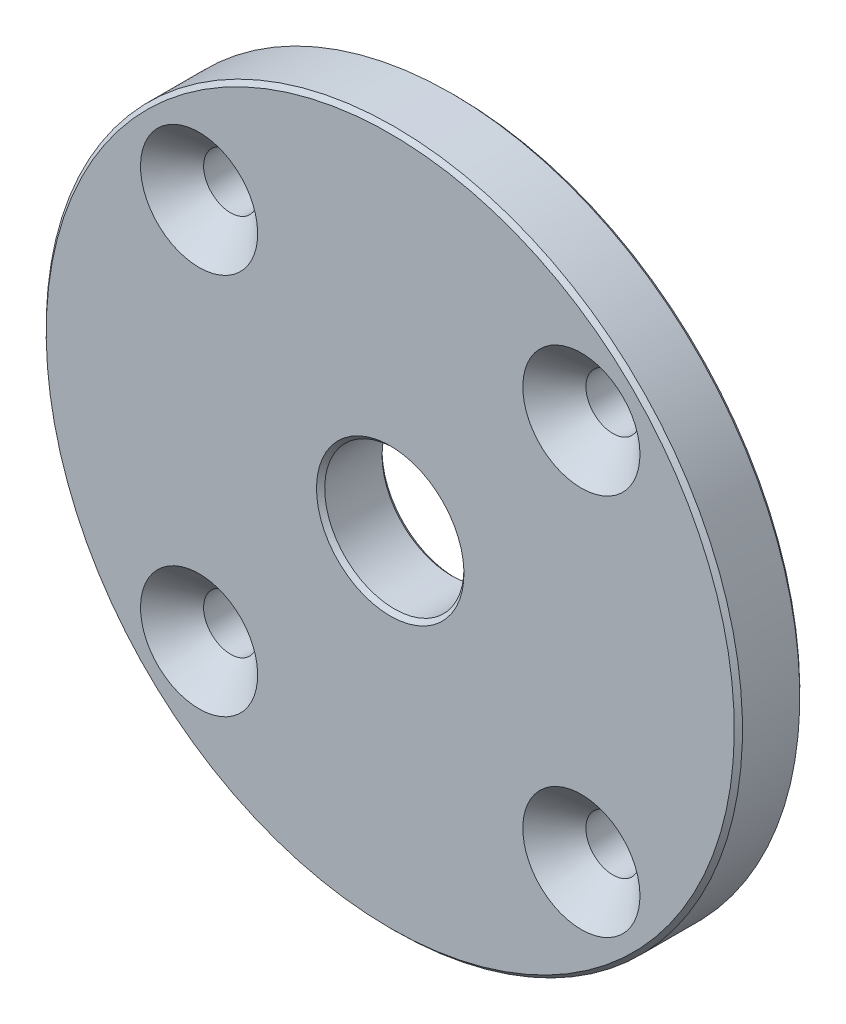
ISO-10303-21;
HEADER;
FILE_DESCRIPTION(('STEP AP214'),'2;1');
FILE_NAME('part.step','',(''),(''),'','','');
FILE_SCHEMA(('AUTOMOTIVE_DESIGN { 1 0 10303 214 1 1 1 1 }'));
ENDSEC;
DATA;
#1=APPLICATION_CONTEXT('core data for automotive mechanical design processes');
#2=APPLICATION_PROTOCOL_DEFINITION('international standard','automotive_design',2000,#1);
#3=PRODUCT_CONTEXT('',#1,'mechanical');
#4=PRODUCT('Part','Part','',(#3));
#5=PRODUCT_RELATED_PRODUCT_CATEGORY('part','',(#4));
#6=PRODUCT_DEFINITION_FORMATION('','',#4);
#7=PRODUCT_DEFINITION_CONTEXT('part definition',#1,'design');
#8=PRODUCT_DEFINITION('design','',#6,#7);
#9=PRODUCT_DEFINITION_SHAPE('','',#8);
#10=(LENGTH_UNIT() NAMED_UNIT(*) SI_UNIT(.MILLI.,.METRE.));
#11=(NAMED_UNIT(*) PLANE_ANGLE_UNIT() SI_UNIT($,.RADIAN.));
#12=(NAMED_UNIT(*) SI_UNIT($,.STERADIAN.) SOLID_ANGLE_UNIT());
#13=UNCERTAINTY_MEASURE_WITH_UNIT(LENGTH_MEASURE(1.E-05),#10,'distance_accuracy_value','');
#14=(GEOMETRIC_REPRESENTATION_CONTEXT(3) GLOBAL_UNCERTAINTY_ASSIGNED_CONTEXT((#13)) GLOBAL_UNIT_ASSIGNED_CONTEXT((#10,
#11,#12)) REPRESENTATION_CONTEXT('',''));
#15=CARTESIAN_POINT('',(0.,0.,0.));
#16=DIRECTION('',(0.,0.,1.));
#17=DIRECTION('',(1.,0.,0.));
#18=AXIS2_PLACEMENT_3D('',#15,#16,#17);
#19=CARTESIAN_POINT('',(0.,0.,0.));
#20=DIRECTION('',(0.,0.,1.));
#21=DIRECTION('',(0.,-1.,0.));
#22=AXIS2_PLACEMENT_3D('',#19,#20,#21);
#23=CYLINDRICAL_SURFACE('',#22,8.5);
#24=CARTESIAN_POINT('',(0.,0.,-7.5));
#25=DIRECTION('',(0.,0.,-1.));
#26=DIRECTION('',(0.,1.,0.));
#27=AXIS2_PLACEMENT_3D('',#24,#25,#26);
#28=CIRCLE('',#27,8.5);
#29=CARTESIAN_POINT('',(0.,8.49999999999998,-7.50000000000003));
#30=VERTEX_POINT('',#29);
#31=EDGE_CURVE('E37',#30,#30,#28,.T.);
#32=ORIENTED_EDGE('',*,*,#31,.T.);
#33=EDGE_LOOP('',(#32));
#34=FACE_BOUND('',#33,.T.);
#35=CARTESIAN_POINT('',(0.,0.,-0.499999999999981));
#36=DIRECTION('',(0.,0.,1.));
#37=DIRECTION('',(0.,-1.,0.));
#38=AXIS2_PLACEMENT_3D('',#35,#36,#37);
#39=CIRCLE('',#38,8.5);
#40=CARTESIAN_POINT('',(0.,-8.5,-0.499999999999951));
#41=VERTEX_POINT('',#40);
#42=EDGE_CURVE('E40',#41,#41,#39,.T.);
#43=ORIENTED_EDGE('',*,*,#42,.T.);
#44=EDGE_LOOP('',(#43));
#45=FACE_BOUND('',#44,.T.);
#46=ADVANCED_FACE('F14',(#34,#45),#23,.F.);
#47=CARTESIAN_POINT('',(8.5,0.,-8.));
#48=DIRECTION('',(0.,0.,-1.));
#49=DIRECTION('',(0.,1.,0.));
#50=AXIS2_PLACEMENT_3D('',#47,#48,#49);
#51=PLANE('',#50);
#52=CARTESIAN_POINT('',(-23.3345237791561,23.334523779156,-8.));
#53=DIRECTION('',(0.,0.,-1.));
#54=DIRECTION('',(0.,1.,0.));
#55=AXIS2_PLACEMENT_3D('',#52,#53,#54);
#56=CIRCLE('',#55,3.3);
#57=CARTESIAN_POINT('',(-23.3345237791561,26.634523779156,-8.00000000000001));
#58=VERTEX_POINT('',#57);
#59=EDGE_CURVE('E9',#58,#58,#56,.T.);
#60=ORIENTED_EDGE('',*,*,#59,.F.);
#61=EDGE_LOOP('',(#60));
#62=FACE_BOUND('',#61,.T.);
#63=CARTESIAN_POINT('',(-23.334523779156,-23.3345237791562,-8.));
#64=DIRECTION('',(0.,0.,-1.));
#65=DIRECTION('',(0.,1.,0.));
#66=AXIS2_PLACEMENT_3D('',#63,#64,#65);
#67=CIRCLE('',#66,3.3);
#68=CARTESIAN_POINT('',(-23.334523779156,-20.0345237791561,-8.00000000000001));
#69=VERTEX_POINT('',#68);
#70=EDGE_CURVE('E21',#69,#69,#67,.T.);
#71=ORIENTED_EDGE('',*,*,#70,.F.);
#72=EDGE_LOOP('',(#71));
#73=FACE_BOUND('',#72,.T.);
#74=CARTESIAN_POINT('',(23.3345237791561,-23.3345237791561,-8.));
#75=DIRECTION('',(0.,0.,-1.));
#76=DIRECTION('',(0.,1.,0.));
#77=AXIS2_PLACEMENT_3D('',#74,#75,#76);
#78=CIRCLE('',#77,3.3);
#79=CARTESIAN_POINT('',(23.3345237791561,-20.0345237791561,-8.00000000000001));
#80=VERTEX_POINT('',#79);
#81=EDGE_CURVE('E25',#80,#80,#78,.T.);
#82=ORIENTED_EDGE('',*,*,#81,.F.);
#83=EDGE_LOOP('',(#82));
#84=FACE_BOUND('',#83,.T.);
#85=CARTESIAN_POINT('',(23.334523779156,23.334523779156,-8.));
#86=DIRECTION('',(0.,0.,-1.));
#87=DIRECTION('',(0.,1.,0.));
#88=AXIS2_PLACEMENT_3D('',#85,#86,#87);
#89=CIRCLE('',#88,3.3);
#90=CARTESIAN_POINT('',(23.334523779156,26.634523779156,-8.00000000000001));
#91=VERTEX_POINT('',#90);
#92=EDGE_CURVE('E29',#91,#91,#89,.T.);
#93=ORIENTED_EDGE('',*,*,#92,.F.);
#94=EDGE_LOOP('',(#93));
#95=FACE_BOUND('',#94,.T.);
#96=CARTESIAN_POINT('',(0.,0.,-8.));
#97=DIRECTION('',(0.,0.,-1.));
#98=DIRECTION('',(0.,1.,0.));
#99=AXIS2_PLACEMENT_3D('',#96,#97,#98);
#100=CIRCLE('',#99,9.);
#101=CARTESIAN_POINT('',(0.,8.99999999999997,-8.00000000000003));
#102=VERTEX_POINT('',#101);
#103=EDGE_CURVE('E43',#102,#102,#100,.F.);
#104=ORIENTED_EDGE('',*,*,#103,.T.);
#105=EDGE_LOOP('',(#104));
#106=FACE_BOUND('',#105,.T.);
#107=CARTESIAN_POINT('',(0.,0.,-8.));
#108=DIRECTION('',(0.,0.,-1.));
#109=DIRECTION('',(0.,1.,0.));
#110=AXIS2_PLACEMENT_3D('',#107,#108,#109);
#111=CIRCLE('',#110,42.);
#112=CARTESIAN_POINT('',(0.,42.,-8.00000000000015));
#113=VERTEX_POINT('',#112);
#114=EDGE_CURVE('E46',#113,#113,#111,.T.);
#115=ORIENTED_EDGE('',*,*,#114,.T.);
#116=EDGE_LOOP('',(#115));
#117=FACE_BOUND('',#116,.T.);
#118=ADVANCED_FACE('F114',(#62,#73,#84,#95,#106,#117),#51,.T.);
#119=CARTESIAN_POINT('',(0.,0.,0.));
#120=DIRECTION('',(0.,0.,1.));
#121=DIRECTION('',(0.,-1.,0.));
#122=AXIS2_PLACEMENT_3D('',#119,#120,#121);
#123=CYLINDRICAL_SURFACE('',#122,42.5);
#124=CARTESIAN_POINT('',(0.,0.,-0.500000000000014));
#125=DIRECTION('',(0.,0.,1.));
#126=DIRECTION('',(0.,-1.,0.));
#127=AXIS2_PLACEMENT_3D('',#124,#125,#126);
#128=CIRCLE('',#127,42.5);
#129=CARTESIAN_POINT('',(0.,-42.5,-0.499999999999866));
#130=VERTEX_POINT('',#129);
#131=EDGE_CURVE('E49',#130,#130,#128,.F.);
#132=ORIENTED_EDGE('',*,*,#131,.T.);
#133=EDGE_LOOP('',(#132));
#134=FACE_BOUND('',#133,.T.);
#135=CARTESIAN_POINT('',(0.,0.,-7.5));
#136=DIRECTION('',(0.,0.,-1.));
#137=DIRECTION('',(0.,1.,0.));
#138=AXIS2_PLACEMENT_3D('',#135,#136,#137);
#139=CIRCLE('',#138,42.5);
#140=CARTESIAN_POINT('',(0.,42.5,-7.50000000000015));
#141=VERTEX_POINT('',#140);
#142=EDGE_CURVE('E52',#141,#141,#139,.F.);
#143=ORIENTED_EDGE('',*,*,#142,.T.);
#144=EDGE_LOOP('',(#143));
#145=FACE_BOUND('',#144,.T.);
#146=ADVANCED_FACE('F89',(#134,#145),#123,.T.);
#147=CARTESIAN_POINT('',(8.5,0.,0.));
#148=DIRECTION('',(0.,0.,1.));
#149=DIRECTION('',(0.,-1.,0.));
#150=AXIS2_PLACEMENT_3D('',#147,#148,#149);
#151=PLANE('',#150);
#152=CARTESIAN_POINT('',(0.,0.,0.));
#153=DIRECTION('',(0.,0.,1.));
#154=DIRECTION('',(0.,-1.,0.));
#155=AXIS2_PLACEMENT_3D('',#152,#153,#154);
#156=CIRCLE('',#155,9.);
#157=CARTESIAN_POINT('',(0.,-9.,0.));
#158=VERTEX_POINT('',#157);
#159=EDGE_CURVE('E34',#158,#158,#156,.F.);
#160=ORIENTED_EDGE('',*,*,#159,.T.);
#161=EDGE_LOOP('',(#160));
#162=FACE_BOUND('',#161,.T.);
#163=CARTESIAN_POINT('',(23.334523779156,23.3345237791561,0.));
#164=DIRECTION('',(0.,0.,1.));
#165=DIRECTION('',(0.,-1.,0.));
#166=AXIS2_PLACEMENT_3D('',#163,#164,#165);
#167=CIRCLE('',#166,7.15);
#168=CARTESIAN_POINT('',(23.334523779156,16.1845237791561,0.));
#169=VERTEX_POINT('',#168);
#170=EDGE_CURVE('E79',#169,#169,#167,.T.);
#171=ORIENTED_EDGE('',*,*,#170,.F.);
#172=EDGE_LOOP('',(#171));
#173=FACE_BOUND('',#172,.T.);
#174=CARTESIAN_POINT('',(23.3345237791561,-23.334523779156,0.));
#175=DIRECTION('',(0.,0.,1.));
#176=DIRECTION('',(0.,-1.,0.));
#177=AXIS2_PLACEMENT_3D('',#174,#175,#176);
#178=CIRCLE('',#177,7.15);
#179=CARTESIAN_POINT('',(23.3345237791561,-30.484523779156,1.06436145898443E-13));
#180=VERTEX_POINT('',#179);
#181=EDGE_CURVE('E73',#180,#180,#178,.T.);
#182=ORIENTED_EDGE('',*,*,#181,.F.);
#183=EDGE_LOOP('',(#182));
#184=FACE_BOUND('',#183,.T.);
#185=CARTESIAN_POINT('',(-23.334523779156,-23.3345237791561,0.));
#186=DIRECTION('',(0.,0.,1.));
#187=DIRECTION('',(0.,-1.,0.));
#188=AXIS2_PLACEMENT_3D('',#185,#186,#187);
#189=CIRCLE('',#188,7.15);
#190=CARTESIAN_POINT('',(-23.334523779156,-30.4845237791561,1.06436145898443E-13));
#191=VERTEX_POINT('',#190);
#192=EDGE_CURVE('E67',#191,#191,#189,.T.);
#193=ORIENTED_EDGE('',*,*,#192,.F.);
#194=EDGE_LOOP('',(#193));
#195=FACE_BOUND('',#194,.T.);
#196=CARTESIAN_POINT('',(-23.3345237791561,23.334523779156,0.));
#197=DIRECTION('',(0.,0.,1.));
#198=DIRECTION('',(0.,-1.,0.));
#199=AXIS2_PLACEMENT_3D('',#196,#197,#198);
#200=CIRCLE('',#199,7.15);
#201=CARTESIAN_POINT('',(-23.3345237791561,16.184523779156,0.));
#202=VERTEX_POINT('',#201);
#203=EDGE_CURVE('E61',#202,#202,#200,.T.);
#204=ORIENTED_EDGE('',*,*,#203,.F.);
#205=EDGE_LOOP('',(#204));
#206=FACE_BOUND('',#205,.T.);
#207=CARTESIAN_POINT('',(0.,0.,0.));
#208=DIRECTION('',(0.,0.,1.));
#209=DIRECTION('',(0.,-1.,0.));
#210=AXIS2_PLACEMENT_3D('',#207,#208,#209);
#211=CIRCLE('',#210,42.);
#212=CARTESIAN_POINT('',(0.,-42.,1.46642216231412E-13));
#213=VERTEX_POINT('',#212);
#214=EDGE_CURVE('E55',#213,#213,#211,.T.);
#215=ORIENTED_EDGE('',*,*,#214,.T.);
#216=EDGE_LOOP('',(#215));
#217=FACE_BOUND('',#216,.T.);
#218=ADVANCED_FACE('F85',(#162,#173,#184,#195,#206,#217),#151,.T.);
#219=CARTESIAN_POINT('',(0.,0.,0.));
#220=DIRECTION('',(0.,0.,-1.));
#221=DIRECTION('',(0.,1.,0.));
#222=AXIS2_PLACEMENT_3D('',#219,#220,#221);
#223=CONICAL_SURFACE('',#222,42.,0.785398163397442);
#224=ORIENTED_EDGE('',*,*,#131,.F.);
#225=EDGE_LOOP('',(#224));
#226=FACE_BOUND('',#225,.T.);
#227=ORIENTED_EDGE('',*,*,#214,.F.);
#228=EDGE_LOOP('',(#227));
#229=FACE_BOUND('',#228,.T.);
#230=ADVANCED_FACE('F88',(#226,#229),#223,.T.);
#231=CARTESIAN_POINT('',(0.,0.,-7.5));
#232=DIRECTION('',(0.,0.,1.));
#233=DIRECTION('',(0.,-1.,0.));
#234=AXIS2_PLACEMENT_3D('',#231,#232,#233);
#235=CONICAL_SURFACE('',#234,42.5,0.785398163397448);
#236=ORIENTED_EDGE('',*,*,#114,.F.);
#237=EDGE_LOOP('',(#236));
#238=FACE_BOUND('',#237,.T.);
#239=ORIENTED_EDGE('',*,*,#142,.F.);
#240=EDGE_LOOP('',(#239));
#241=FACE_BOUND('',#240,.T.);
#242=ADVANCED_FACE('F101',(#238,#241),#235,.T.);
#243=CARTESIAN_POINT('',(-23.3345237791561,23.334523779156,0.));
#244=DIRECTION('',(0.,0.,1.));
#245=DIRECTION('',(0.,-1.,0.));
#246=AXIS2_PLACEMENT_3D('',#243,#244,#245);
#247=CYLINDRICAL_SURFACE('',#246,3.3);
#248=CARTESIAN_POINT('',(-23.3345237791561,23.334523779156,-3.85000000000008));
#249=DIRECTION('',(0.,0.,1.));
#250=DIRECTION('',(0.,-1.,0.));
#251=AXIS2_PLACEMENT_3D('',#248,#249,#250);
#252=CIRCLE('',#251,3.3);
#253=CARTESIAN_POINT('',(-23.3345237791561,20.034523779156,-3.85000000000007));
#254=VERTEX_POINT('',#253);
#255=EDGE_CURVE('E58',#254,#254,#252,.T.);
#256=ORIENTED_EDGE('',*,*,#255,.T.);
#257=EDGE_LOOP('',(#256));
#258=FACE_BOUND('',#257,.T.);
#259=ORIENTED_EDGE('',*,*,#59,.T.);
#260=EDGE_LOOP('',(#259));
#261=FACE_BOUND('',#260,.T.);
#262=ADVANCED_FACE('F16',(#258,#261),#247,.F.);
#263=CARTESIAN_POINT('',(-23.3345237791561,23.334523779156,0.));
#264=DIRECTION('',(0.,0.,1.));
#265=DIRECTION('',(0.,-1.,0.));
#266=AXIS2_PLACEMENT_3D('',#263,#264,#265);
#267=CONICAL_SURFACE('',#266,7.15,0.785398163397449);
#268=ORIENTED_EDGE('',*,*,#255,.F.);
#269=EDGE_LOOP('',(#268));
#270=FACE_BOUND('',#269,.T.);
#271=ORIENTED_EDGE('',*,*,#203,.T.);
#272=EDGE_LOOP('',(#271));
#273=FACE_BOUND('',#272,.T.);
#274=ADVANCED_FACE('F127',(#270,#273),#267,.F.);
#275=CARTESIAN_POINT('',(-23.334523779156,-23.3345237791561,0.));
#276=DIRECTION('',(0.,0.,1.));
#277=DIRECTION('',(0.,-1.,0.));
#278=AXIS2_PLACEMENT_3D('',#275,#276,#277);
#279=CYLINDRICAL_SURFACE('',#278,3.3);
#280=CARTESIAN_POINT('',(-23.334523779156,-23.3345237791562,-3.84999999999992));
#281=DIRECTION('',(0.,0.,1.));
#282=DIRECTION('',(0.,-1.,0.));
#283=AXIS2_PLACEMENT_3D('',#280,#281,#282);
#284=CIRCLE('',#283,3.3);
#285=CARTESIAN_POINT('',(-23.334523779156,-26.6345237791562,-3.84999999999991));
#286=VERTEX_POINT('',#285);
#287=EDGE_CURVE('E64',#286,#286,#284,.T.);
#288=ORIENTED_EDGE('',*,*,#287,.T.);
#289=EDGE_LOOP('',(#288));
#290=FACE_BOUND('',#289,.T.);
#291=ORIENTED_EDGE('',*,*,#70,.T.);
#292=EDGE_LOOP('',(#291));
#293=FACE_BOUND('',#292,.T.);
#294=ADVANCED_FACE('F130',(#290,#293),#279,.F.);
#295=CARTESIAN_POINT('',(-23.334523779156,-23.3345237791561,0.));
#296=DIRECTION('',(0.,0.,1.));
#297=DIRECTION('',(0.,-1.,0.));
#298=AXIS2_PLACEMENT_3D('',#295,#296,#297);
#299=CONICAL_SURFACE('',#298,7.15,0.785398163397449);
#300=ORIENTED_EDGE('',*,*,#287,.F.);
#301=EDGE_LOOP('',(#300));
#302=FACE_BOUND('',#301,.T.);
#303=ORIENTED_EDGE('',*,*,#192,.T.);
#304=EDGE_LOOP('',(#303));
#305=FACE_BOUND('',#304,.T.);
#306=ADVANCED_FACE('F132',(#302,#305),#299,.F.);
#307=CARTESIAN_POINT('',(23.3345237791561,-23.334523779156,0.));
#308=DIRECTION('',(0.,0.,1.));
#309=DIRECTION('',(0.,-1.,0.));
#310=AXIS2_PLACEMENT_3D('',#307,#308,#309);
#311=CYLINDRICAL_SURFACE('',#310,3.3);
#312=CARTESIAN_POINT('',(23.3345237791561,-23.334523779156,-3.84999999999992));
#313=DIRECTION('',(0.,0.,1.));
#314=DIRECTION('',(0.,-1.,0.));
#315=AXIS2_PLACEMENT_3D('',#312,#313,#314);
#316=CIRCLE('',#315,3.3);
#317=CARTESIAN_POINT('',(23.3345237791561,-26.634523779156,-3.84999999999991));
#318=VERTEX_POINT('',#317);
#319=EDGE_CURVE('E70',#318,#318,#316,.T.);
#320=ORIENTED_EDGE('',*,*,#319,.T.);
#321=EDGE_LOOP('',(#320));
#322=FACE_BOUND('',#321,.T.);
#323=ORIENTED_EDGE('',*,*,#81,.T.);
#324=EDGE_LOOP('',(#323));
#325=FACE_BOUND('',#324,.T.);
#326=ADVANCED_FACE('F135',(#322,#325),#311,.F.);
#327=CARTESIAN_POINT('',(23.3345237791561,-23.334523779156,0.));
#328=DIRECTION('',(0.,0.,1.));
#329=DIRECTION('',(0.,-1.,0.));
#330=AXIS2_PLACEMENT_3D('',#327,#328,#329);
#331=CONICAL_SURFACE('',#330,7.15,0.785398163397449);
#332=ORIENTED_EDGE('',*,*,#319,.F.);
#333=EDGE_LOOP('',(#332));
#334=FACE_BOUND('',#333,.T.);
#335=ORIENTED_EDGE('',*,*,#181,.T.);
#336=EDGE_LOOP('',(#335));
#337=FACE_BOUND('',#336,.T.);
#338=ADVANCED_FACE('F137',(#334,#337),#331,.F.);
#339=CARTESIAN_POINT('',(23.334523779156,23.3345237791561,0.));
#340=DIRECTION('',(0.,0.,1.));
#341=DIRECTION('',(0.,-1.,0.));
#342=AXIS2_PLACEMENT_3D('',#339,#340,#341);
#343=CYLINDRICAL_SURFACE('',#342,3.3);
#344=CARTESIAN_POINT('',(23.334523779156,23.3345237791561,-3.85000000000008));
#345=DIRECTION('',(0.,0.,1.));
#346=DIRECTION('',(0.,-1.,0.));
#347=AXIS2_PLACEMENT_3D('',#344,#345,#346);
#348=CIRCLE('',#347,3.3);
#349=CARTESIAN_POINT('',(23.334523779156,20.0345237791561,-3.85000000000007));
#350=VERTEX_POINT('',#349);
#351=EDGE_CURVE('E76',#350,#350,#348,.T.);
#352=ORIENTED_EDGE('',*,*,#351,.T.);
#353=EDGE_LOOP('',(#352));
#354=FACE_BOUND('',#353,.T.);
#355=ORIENTED_EDGE('',*,*,#92,.T.);
#356=EDGE_LOOP('',(#355));
#357=FACE_BOUND('',#356,.T.);
#358=ADVANCED_FACE('F140',(#354,#357),#343,.F.);
#359=CARTESIAN_POINT('',(23.334523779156,23.3345237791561,0.));
#360=DIRECTION('',(0.,0.,1.));
#361=DIRECTION('',(0.,-1.,0.));
#362=AXIS2_PLACEMENT_3D('',#359,#360,#361);
#363=CONICAL_SURFACE('',#362,7.15,0.785398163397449);
#364=ORIENTED_EDGE('',*,*,#351,.F.);
#365=EDGE_LOOP('',(#364));
#366=FACE_BOUND('',#365,.T.);
#367=ORIENTED_EDGE('',*,*,#170,.T.);
#368=EDGE_LOOP('',(#367));
#369=FACE_BOUND('',#368,.T.);
#370=ADVANCED_FACE('F83',(#366,#369),#363,.F.);
#371=CARTESIAN_POINT('',(0.,0.,-8.));
#372=DIRECTION('',(0.,0.,-1.));
#373=DIRECTION('',(0.,1.,0.));
#374=AXIS2_PLACEMENT_3D('',#371,#372,#373);
#375=CONICAL_SURFACE('',#374,9.,0.785398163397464);
#376=ORIENTED_EDGE('',*,*,#31,.F.);
#377=EDGE_LOOP('',(#376));
#378=FACE_BOUND('',#377,.T.);
#379=ORIENTED_EDGE('',*,*,#103,.F.);
#380=EDGE_LOOP('',(#379));
#381=FACE_BOUND('',#380,.T.);
#382=ADVANCED_FACE('F143',(#378,#381),#375,.F.);
#383=CARTESIAN_POINT('',(0.,0.,-0.499999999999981));
#384=DIRECTION('',(0.,0.,1.));
#385=DIRECTION('',(0.,-1.,0.));
#386=AXIS2_PLACEMENT_3D('',#383,#384,#385);
#387=CONICAL_SURFACE('',#386,8.5,0.78539816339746);
#388=ORIENTED_EDGE('',*,*,#159,.F.);
#389=EDGE_LOOP('',(#388));
#390=FACE_BOUND('',#389,.T.);
#391=ORIENTED_EDGE('',*,*,#42,.F.);
#392=EDGE_LOOP('',(#391));
#393=FACE_BOUND('',#392,.T.);
#394=ADVANCED_FACE('F150',(#390,#393),#387,.F.);
#395=CLOSED_SHELL('',(#46,#118,#146,#218,#230,#242,#262,#274,#294,#306,#326,#338,#358,#370,#382,#394));
#396=MANIFOLD_SOLID_BREP('B1',#395);
#397=ADVANCED_BREP_SHAPE_REPRESENTATION('',(#18,#396),#14);
#398=SHAPE_DEFINITION_REPRESENTATION(#9,#397);
ENDSEC;
END-ISO-10303-21;
